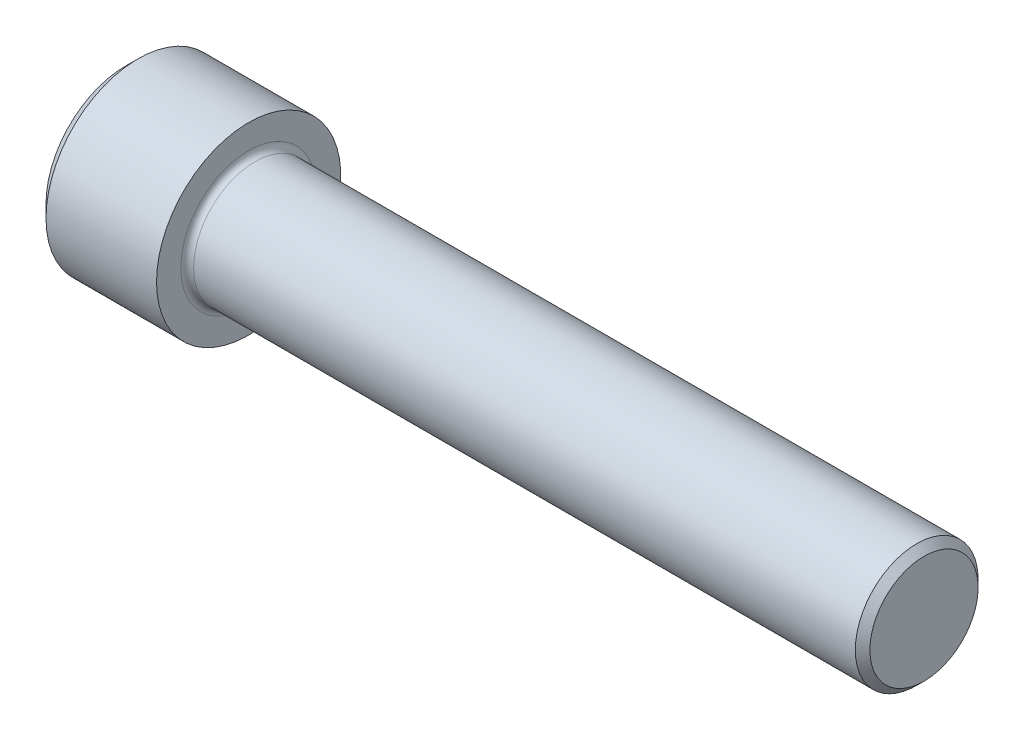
ISO-10303-21;
HEADER;
FILE_DESCRIPTION(('STEP AP214'),'2;1');
FILE_NAME('part.step','',(''),(''),'','','');
FILE_SCHEMA(('AUTOMOTIVE_DESIGN { 1 0 10303 214 1 1 1 1 }'));
ENDSEC;
DATA;
#1=APPLICATION_CONTEXT('core data for automotive mechanical design processes');
#2=APPLICATION_PROTOCOL_DEFINITION('international standard','automotive_design',2000,#1);
#3=PRODUCT_CONTEXT('',#1,'mechanical');
#4=PRODUCT('Part','Part','',(#3));
#5=PRODUCT_RELATED_PRODUCT_CATEGORY('part','',(#4));
#6=PRODUCT_DEFINITION_FORMATION('','',#4);
#7=PRODUCT_DEFINITION_CONTEXT('part definition',#1,'design');
#8=PRODUCT_DEFINITION('design','',#6,#7);
#9=PRODUCT_DEFINITION_SHAPE('','',#8);
#10=(LENGTH_UNIT() NAMED_UNIT(*) SI_UNIT(.MILLI.,.METRE.));
#11=(NAMED_UNIT(*) PLANE_ANGLE_UNIT() SI_UNIT($,.RADIAN.));
#12=(NAMED_UNIT(*) SI_UNIT($,.STERADIAN.) SOLID_ANGLE_UNIT());
#13=UNCERTAINTY_MEASURE_WITH_UNIT(LENGTH_MEASURE(1.E-05),#10,'distance_accuracy_value','');
#14=(GEOMETRIC_REPRESENTATION_CONTEXT(3) GLOBAL_UNCERTAINTY_ASSIGNED_CONTEXT((#13)) GLOBAL_UNIT_ASSIGNED_CONTEXT((#10,
#11,#12)) REPRESENTATION_CONTEXT('',''));
#15=CARTESIAN_POINT('',(0.,0.,0.));
#16=DIRECTION('',(0.,0.,1.));
#17=DIRECTION('',(1.,0.,0.));
#18=AXIS2_PLACEMENT_3D('',#15,#16,#17);
#19=CARTESIAN_POINT('',(0.,0.,0.));
#20=DIRECTION('',(-1.,0.,0.));
#21=DIRECTION('',(0.,0.,1.));
#22=AXIS2_PLACEMENT_3D('',#19,#20,#21);
#23=PLANE('',#22);
#24=DIRECTION('',(0.,-0.499999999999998,0.86602540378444));
#25=VECTOR('',#24,1.);
#26=CARTESIAN_POINT('',(0.,5.49926131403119,0.));
#27=LINE('',#26,#25);
#28=CARTESIAN_POINT('',(0.,5.49926131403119,0.));
#29=VERTEX_POINT('',#28);
#30=CARTESIAN_POINT('',(0.,2.74963065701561,4.76249999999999));
#31=VERTEX_POINT('',#30);
#32=EDGE_CURVE('E113',#29,#31,#27,.T.);
#33=ORIENTED_EDGE('',*,*,#32,.T.);
#34=DIRECTION('',(0.,1.,0.));
#35=VECTOR('',#34,1.);
#36=CARTESIAN_POINT('',(0.,-2.74963065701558,4.7625));
#37=LINE('',#36,#35);
#38=CARTESIAN_POINT('',(0.,-2.74963065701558,4.7625));
#39=VERTEX_POINT('',#38);
#40=EDGE_CURVE('E102',#39,#31,#37,.T.);
#41=ORIENTED_EDGE('',*,*,#40,.F.);
#42=DIRECTION('',(0.,-0.500000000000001,-0.866025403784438));
#43=VECTOR('',#42,1.);
#44=CARTESIAN_POINT('',(0.,-2.74963065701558,4.7625));
#45=LINE('',#44,#43);
#46=CARTESIAN_POINT('',(0.,-5.49926131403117,0.));
#47=VERTEX_POINT('',#46);
#48=EDGE_CURVE('E112',#39,#47,#45,.T.);
#49=ORIENTED_EDGE('',*,*,#48,.T.);
#50=DIRECTION('',(0.,0.499999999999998,-0.86602540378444));
#51=VECTOR('',#50,1.);
#52=CARTESIAN_POINT('',(0.,-5.49926131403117,0.));
#53=LINE('',#52,#51);
#54=CARTESIAN_POINT('',(0.,-2.74963065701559,-4.7625));
#55=VERTEX_POINT('',#54);
#56=EDGE_CURVE('E131',#47,#55,#53,.T.);
#57=ORIENTED_EDGE('',*,*,#56,.T.);
#58=DIRECTION('',(0.,-1.,0.));
#59=VECTOR('',#58,1.);
#60=CARTESIAN_POINT('',(0.,2.74963065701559,-4.76250000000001));
#61=LINE('',#60,#59);
#62=CARTESIAN_POINT('',(0.,2.74963065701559,-4.76250000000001));
#63=VERTEX_POINT('',#62);
#64=EDGE_CURVE('E134',#63,#55,#61,.T.);
#65=ORIENTED_EDGE('',*,*,#64,.F.);
#66=DIRECTION('',(0.,-0.500000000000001,-0.866025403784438));
#67=VECTOR('',#66,1.);
#68=CARTESIAN_POINT('',(0.,5.49926131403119,0.));
#69=LINE('',#68,#67);
#70=EDGE_CURVE('E127',#29,#63,#69,.T.);
#71=ORIENTED_EDGE('',*,*,#70,.F.);
#72=EDGE_LOOP('',(#33,#41,#49,#57,#65,#71));
#73=FACE_BOUND('',#72,.T.);
#74=CARTESIAN_POINT('',(0.,0.,0.));
#75=DIRECTION('',(-1.,0.,0.));
#76=DIRECTION('',(0.,0.,1.));
#77=AXIS2_PLACEMENT_3D('',#74,#75,#76);
#78=CIRCLE('',#77,8.255);
#79=CARTESIAN_POINT('',(0.,0.,8.255));
#80=VERTEX_POINT('',#79);
#81=EDGE_CURVE('E172',#80,#80,#78,.T.);
#82=ORIENTED_EDGE('',*,*,#81,.T.);
#83=EDGE_LOOP('',(#82));
#84=FACE_BOUND('',#83,.T.);
#85=ADVANCED_FACE('F30',(#73,#84),#23,.T.);
#86=CARTESIAN_POINT('',(82.55,5.59435,0.));
#87=DIRECTION('',(1.,0.,0.));
#88=DIRECTION('',(0.,0.,-1.));
#89=AXIS2_PLACEMENT_3D('',#86,#87,#88);
#90=PLANE('',#89);
#91=CARTESIAN_POINT('',(82.55,0.,0.));
#92=DIRECTION('',(-1.,0.,0.));
#93=DIRECTION('',(0.,0.,1.));
#94=AXIS2_PLACEMENT_3D('',#91,#92,#93);
#95=CIRCLE('',#94,5.59435);
#96=CARTESIAN_POINT('',(82.55,0.,5.59435));
#97=VERTEX_POINT('',#96);
#98=EDGE_CURVE('E185',#97,#97,#95,.T.);
#99=ORIENTED_EDGE('',*,*,#98,.F.);
#100=EDGE_LOOP('',(#99));
#101=FACE_BOUND('',#100,.T.);
#102=ADVANCED_FACE('F32',(#101),#90,.T.);
#103=CARTESIAN_POINT('',(82.55,0.,0.));
#104=DIRECTION('',(-1.,0.,0.));
#105=DIRECTION('',(0.,0.,1.));
#106=AXIS2_PLACEMENT_3D('',#103,#104,#105);
#107=CONICAL_SURFACE('',#106,5.59435,0.785398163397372);
#108=CARTESIAN_POINT('',(81.79435,0.,0.));
#109=DIRECTION('',(-1.,0.,0.));
#110=DIRECTION('',(0.,0.,1.));
#111=AXIS2_PLACEMENT_3D('',#108,#109,#110);
#112=CIRCLE('',#111,6.34999999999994);
#113=CARTESIAN_POINT('',(81.79435,0.,6.34999999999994));
#114=VERTEX_POINT('',#113);
#115=EDGE_CURVE('E182',#114,#114,#112,.T.);
#116=ORIENTED_EDGE('',*,*,#115,.F.);
#117=EDGE_LOOP('',(#116));
#118=FACE_BOUND('',#117,.T.);
#119=ORIENTED_EDGE('',*,*,#98,.T.);
#120=EDGE_LOOP('',(#119));
#121=FACE_BOUND('',#120,.T.);
#122=ADVANCED_FACE('F213',(#118,#121),#107,.T.);
#123=CARTESIAN_POINT('',(-31.75,0.,0.));
#124=DIRECTION('',(-1.,0.,0.));
#125=DIRECTION('',(0.,0.,1.));
#126=AXIS2_PLACEMENT_3D('',#123,#124,#125);
#127=CYLINDRICAL_SURFACE('',#126,6.34999999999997);
#128=CARTESIAN_POINT('',(13.3604,0.,0.));
#129=DIRECTION('',(1.,0.,0.));
#130=DIRECTION('',(0.,0.,-1.));
#131=AXIS2_PLACEMENT_3D('',#128,#129,#130);
#132=CIRCLE('',#131,6.34999999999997);
#133=CARTESIAN_POINT('',(13.3604,0.,-6.34999999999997));
#134=VERTEX_POINT('',#133);
#135=EDGE_CURVE('E11',#134,#134,#132,.T.);
#136=ORIENTED_EDGE('',*,*,#135,.T.);
#137=EDGE_LOOP('',(#136));
#138=FACE_BOUND('',#137,.T.);
#139=ORIENTED_EDGE('',*,*,#115,.T.);
#140=EDGE_LOOP('',(#139));
#141=FACE_BOUND('',#140,.T.);
#142=ADVANCED_FACE('F221',(#138,#141),#127,.T.);
#143=CARTESIAN_POINT('',(12.7,9.525,0.));
#144=DIRECTION('',(1.,0.,0.));
#145=DIRECTION('',(0.,0.,-1.));
#146=AXIS2_PLACEMENT_3D('',#143,#144,#145);
#147=PLANE('',#146);
#148=CARTESIAN_POINT('',(12.7,0.,0.));
#149=DIRECTION('',(1.,0.,0.));
#150=DIRECTION('',(0.,0.,-1.));
#151=AXIS2_PLACEMENT_3D('',#148,#149,#150);
#152=CIRCLE('',#151,7.01039999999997);
#153=CARTESIAN_POINT('',(12.7,0.,-7.01039999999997));
#154=VERTEX_POINT('',#153);
#155=EDGE_CURVE('E38',#154,#154,#152,.F.);
#156=ORIENTED_EDGE('',*,*,#155,.T.);
#157=EDGE_LOOP('',(#156));
#158=FACE_BOUND('',#157,.T.);
#159=CARTESIAN_POINT('',(12.7,0.,0.));
#160=DIRECTION('',(-1.,0.,0.));
#161=DIRECTION('',(0.,0.,1.));
#162=AXIS2_PLACEMENT_3D('',#159,#160,#161);
#163=CIRCLE('',#162,9.525);
#164=CARTESIAN_POINT('',(12.7,0.,9.525));
#165=VERTEX_POINT('',#164);
#166=EDGE_CURVE('E179',#165,#165,#163,.T.);
#167=ORIENTED_EDGE('',*,*,#166,.F.);
#168=EDGE_LOOP('',(#167));
#169=FACE_BOUND('',#168,.T.);
#170=ADVANCED_FACE('F190',(#158,#169),#147,.T.);
#171=CARTESIAN_POINT('',(-31.75,0.,0.));
#172=DIRECTION('',(-1.,0.,0.));
#173=DIRECTION('',(0.,0.,1.));
#174=AXIS2_PLACEMENT_3D('',#171,#172,#173);
#175=CYLINDRICAL_SURFACE('',#174,9.525);
#176=ORIENTED_EDGE('',*,*,#166,.T.);
#177=EDGE_LOOP('',(#176));
#178=FACE_BOUND('',#177,.T.);
#179=CARTESIAN_POINT('',(1.27,0.,0.));
#180=DIRECTION('',(-1.,0.,0.));
#181=DIRECTION('',(0.,0.,1.));
#182=AXIS2_PLACEMENT_3D('',#179,#180,#181);
#183=CIRCLE('',#182,9.525);
#184=CARTESIAN_POINT('',(1.27,0.,9.525));
#185=VERTEX_POINT('',#184);
#186=EDGE_CURVE('E176',#185,#185,#183,.T.);
#187=ORIENTED_EDGE('',*,*,#186,.F.);
#188=EDGE_LOOP('',(#187));
#189=FACE_BOUND('',#188,.T.);
#190=ADVANCED_FACE('F203',(#178,#189),#175,.T.);
#191=CARTESIAN_POINT('',(0.,0.,0.));
#192=DIRECTION('',(1.,0.,0.));
#193=DIRECTION('',(0.,0.,-1.));
#194=AXIS2_PLACEMENT_3D('',#191,#192,#193);
#195=CONICAL_SURFACE('',#194,8.255,0.78539816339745);
#196=ORIENTED_EDGE('',*,*,#186,.T.);
#197=EDGE_LOOP('',(#196));
#198=FACE_BOUND('',#197,.T.);
#199=ORIENTED_EDGE('',*,*,#81,.F.);
#200=EDGE_LOOP('',(#199));
#201=FACE_BOUND('',#200,.T.);
#202=ADVANCED_FACE('F195',(#198,#201),#195,.T.);
#203=CARTESIAN_POINT('',(13.3604,0.,0.));
#204=DIRECTION('',(1.,0.,0.));
#205=DIRECTION('',(0.,0.,-1.));
#206=AXIS2_PLACEMENT_3D('',#203,#204,#205);
#207=TOROIDAL_SURFACE('',#206,7.01039999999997,0.6604);
#208=ORIENTED_EDGE('',*,*,#135,.F.);
#209=EDGE_LOOP('',(#208));
#210=FACE_BOUND('',#209,.T.);
#211=ORIENTED_EDGE('',*,*,#155,.F.);
#212=EDGE_LOOP('',(#211));
#213=FACE_BOUND('',#212,.T.);
#214=ADVANCED_FACE('F193',(#210,#213),#207,.F.);
#215=CARTESIAN_POINT('',(6.223,5.49926131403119,0.));
#216=DIRECTION('',(0.,-0.86602540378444,-0.499999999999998));
#217=DIRECTION('',(0.,0.499999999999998,-0.86602540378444));
#218=AXIS2_PLACEMENT_3D('',#215,#216,#217);
#219=PLANE('',#218);
#220=ORIENTED_EDGE('',*,*,#32,.F.);
#221=DIRECTION('',(-1.,0.,0.));
#222=VECTOR('',#221,1.);
#223=CARTESIAN_POINT('',(6.223,5.49926131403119,0.));
#224=LINE('',#223,#222);
#225=CARTESIAN_POINT('',(6.223,5.49926131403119,0.));
#226=VERTEX_POINT('',#225);
#227=EDGE_CURVE('E157',#226,#29,#224,.T.);
#228=ORIENTED_EDGE('',*,*,#227,.F.);
#229=DIRECTION('',(0.,-0.499999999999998,0.86602540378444));
#230=VECTOR('',#229,1.);
#231=CARTESIAN_POINT('',(6.223,5.49926131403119,0.));
#232=LINE('',#231,#230);
#233=CARTESIAN_POINT('',(6.223,4.1244459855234,2.38124999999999));
#234=VERTEX_POINT('',#233);
#235=EDGE_CURVE('E137',#226,#234,#232,.T.);
#236=ORIENTED_EDGE('',*,*,#235,.T.);
#237=CARTESIAN_POINT('',(6.223,2.74963065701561,4.76249999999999));
#238=VERTEX_POINT('',#237);
#239=EDGE_CURVE('E121',#234,#238,#232,.T.);
#240=ORIENTED_EDGE('',*,*,#239,.T.);
#241=DIRECTION('',(-1.,0.,0.));
#242=VECTOR('',#241,1.);
#243=CARTESIAN_POINT('',(6.223,2.74963065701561,4.76249999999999));
#244=LINE('',#243,#242);
#245=EDGE_CURVE('E106',#238,#31,#244,.T.);
#246=ORIENTED_EDGE('',*,*,#245,.T.);
#247=EDGE_LOOP('',(#220,#228,#236,#240,#246));
#248=FACE_BOUND('',#247,.T.);
#249=ADVANCED_FACE('F117',(#248),#219,.T.);
#250=CARTESIAN_POINT('',(6.223,-2.74963065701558,4.7625));
#251=DIRECTION('',(0.,0.,1.));
#252=DIRECTION('',(0.,-1.,0.));
#253=AXIS2_PLACEMENT_3D('',#250,#251,#252);
#254=PLANE('',#253);
#255=ORIENTED_EDGE('',*,*,#40,.T.);
#256=ORIENTED_EDGE('',*,*,#245,.F.);
#257=DIRECTION('',(0.,1.,0.));
#258=VECTOR('',#257,1.);
#259=CARTESIAN_POINT('',(6.223,-2.74963065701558,4.7625));
#260=LINE('',#259,#258);
#261=CARTESIAN_POINT('',(6.223,0.,4.76249999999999));
#262=VERTEX_POINT('',#261);
#263=EDGE_CURVE('E139',#262,#238,#260,.T.);
#264=ORIENTED_EDGE('',*,*,#263,.F.);
#265=CARTESIAN_POINT('',(6.223,-2.74963065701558,4.7625));
#266=VERTEX_POINT('',#265);
#267=EDGE_CURVE('E140',#266,#262,#260,.T.);
#268=ORIENTED_EDGE('',*,*,#267,.F.);
#269=DIRECTION('',(-1.,0.,0.));
#270=VECTOR('',#269,1.);
#271=CARTESIAN_POINT('',(6.223,-2.74963065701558,4.7625));
#272=LINE('',#271,#270);
#273=EDGE_CURVE('E108',#266,#39,#272,.T.);
#274=ORIENTED_EDGE('',*,*,#273,.T.);
#275=EDGE_LOOP('',(#255,#256,#264,#268,#274));
#276=FACE_BOUND('',#275,.T.);
#277=ADVANCED_FACE('F104',(#276),#254,.F.);
#278=CARTESIAN_POINT('',(6.223,-2.74963065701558,4.7625));
#279=DIRECTION('',(0.,0.866025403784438,-0.500000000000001));
#280=DIRECTION('',(0.,0.500000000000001,0.866025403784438));
#281=AXIS2_PLACEMENT_3D('',#278,#279,#280);
#282=PLANE('',#281);
#283=ORIENTED_EDGE('',*,*,#48,.F.);
#284=ORIENTED_EDGE('',*,*,#273,.F.);
#285=DIRECTION('',(0.,-0.500000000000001,-0.866025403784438));
#286=VECTOR('',#285,1.);
#287=CARTESIAN_POINT('',(6.223,-2.74963065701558,4.7625));
#288=LINE('',#287,#286);
#289=CARTESIAN_POINT('',(6.223,-4.12444598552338,2.38125));
#290=VERTEX_POINT('',#289);
#291=EDGE_CURVE('E144',#266,#290,#288,.T.);
#292=ORIENTED_EDGE('',*,*,#291,.T.);
#293=CARTESIAN_POINT('',(6.223,-5.49926131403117,0.));
#294=VERTEX_POINT('',#293);
#295=EDGE_CURVE('E143',#290,#294,#288,.T.);
#296=ORIENTED_EDGE('',*,*,#295,.T.);
#297=DIRECTION('',(-1.,0.,0.));
#298=VECTOR('',#297,1.);
#299=CARTESIAN_POINT('',(6.223,-5.49926131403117,0.));
#300=LINE('',#299,#298);
#301=EDGE_CURVE('E165',#294,#47,#300,.T.);
#302=ORIENTED_EDGE('',*,*,#301,.T.);
#303=EDGE_LOOP('',(#283,#284,#292,#296,#302));
#304=FACE_BOUND('',#303,.T.);
#305=ADVANCED_FACE('F284',(#304),#282,.T.);
#306=CARTESIAN_POINT('',(6.223,-5.49926131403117,0.));
#307=DIRECTION('',(0.,0.86602540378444,0.499999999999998));
#308=DIRECTION('',(0.,-0.499999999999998,0.86602540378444));
#309=AXIS2_PLACEMENT_3D('',#306,#307,#308);
#310=PLANE('',#309);
#311=ORIENTED_EDGE('',*,*,#56,.F.);
#312=ORIENTED_EDGE('',*,*,#301,.F.);
#313=DIRECTION('',(0.,0.499999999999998,-0.86602540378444));
#314=VECTOR('',#313,1.);
#315=CARTESIAN_POINT('',(6.223,-5.49926131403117,0.));
#316=LINE('',#315,#314);
#317=CARTESIAN_POINT('',(6.223,-4.12444598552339,-2.38124999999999));
#318=VERTEX_POINT('',#317);
#319=EDGE_CURVE('E148',#294,#318,#316,.T.);
#320=ORIENTED_EDGE('',*,*,#319,.T.);
#321=CARTESIAN_POINT('',(6.223,-2.74963065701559,-4.7625));
#322=VERTEX_POINT('',#321);
#323=EDGE_CURVE('E147',#318,#322,#316,.T.);
#324=ORIENTED_EDGE('',*,*,#323,.T.);
#325=DIRECTION('',(-1.,0.,0.));
#326=VECTOR('',#325,1.);
#327=CARTESIAN_POINT('',(6.223,-2.74963065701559,-4.7625));
#328=LINE('',#327,#326);
#329=EDGE_CURVE('E162',#322,#55,#328,.T.);
#330=ORIENTED_EDGE('',*,*,#329,.T.);
#331=EDGE_LOOP('',(#311,#312,#320,#324,#330));
#332=FACE_BOUND('',#331,.T.);
#333=ADVANCED_FACE('F292',(#332),#310,.T.);
#334=CARTESIAN_POINT('',(6.223,2.74963065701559,-4.76250000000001));
#335=DIRECTION('',(0.,0.,-1.));
#336=DIRECTION('',(0.,1.,0.));
#337=AXIS2_PLACEMENT_3D('',#334,#335,#336);
#338=PLANE('',#337);
#339=ORIENTED_EDGE('',*,*,#64,.T.);
#340=ORIENTED_EDGE('',*,*,#329,.F.);
#341=DIRECTION('',(0.,-1.,0.));
#342=VECTOR('',#341,1.);
#343=CARTESIAN_POINT('',(6.223,2.74963065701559,-4.76250000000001));
#344=LINE('',#343,#342);
#345=CARTESIAN_POINT('',(6.223,0.,-4.7625));
#346=VERTEX_POINT('',#345);
#347=EDGE_CURVE('E151',#346,#322,#344,.T.);
#348=ORIENTED_EDGE('',*,*,#347,.F.);
#349=CARTESIAN_POINT('',(6.223,2.74963065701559,-4.76250000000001));
#350=VERTEX_POINT('',#349);
#351=EDGE_CURVE('E45',#350,#346,#344,.T.);
#352=ORIENTED_EDGE('',*,*,#351,.F.);
#353=DIRECTION('',(-1.,0.,0.));
#354=VECTOR('',#353,1.);
#355=CARTESIAN_POINT('',(6.223,2.74963065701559,-4.76250000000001));
#356=LINE('',#355,#354);
#357=EDGE_CURVE('E159',#350,#63,#356,.T.);
#358=ORIENTED_EDGE('',*,*,#357,.T.);
#359=EDGE_LOOP('',(#339,#340,#348,#352,#358));
#360=FACE_BOUND('',#359,.T.);
#361=ADVANCED_FACE('F301',(#360),#338,.F.);
#362=CARTESIAN_POINT('',(6.223,5.49926131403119,0.));
#363=DIRECTION('',(0.,0.866025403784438,-0.500000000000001));
#364=DIRECTION('',(0.,0.500000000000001,0.866025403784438));
#365=AXIS2_PLACEMENT_3D('',#362,#363,#364);
#366=PLANE('',#365);
#367=ORIENTED_EDGE('',*,*,#70,.T.);
#368=ORIENTED_EDGE('',*,*,#357,.F.);
#369=DIRECTION('',(0.,-0.500000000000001,-0.866025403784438));
#370=VECTOR('',#369,1.);
#371=CARTESIAN_POINT('',(6.223,5.49926131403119,0.));
#372=LINE('',#371,#370);
#373=CARTESIAN_POINT('',(6.223,4.12444598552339,-2.38125000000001));
#374=VERTEX_POINT('',#373);
#375=EDGE_CURVE('E153',#374,#350,#372,.T.);
#376=ORIENTED_EDGE('',*,*,#375,.F.);
#377=EDGE_CURVE('E154',#226,#374,#372,.T.);
#378=ORIENTED_EDGE('',*,*,#377,.F.);
#379=ORIENTED_EDGE('',*,*,#227,.T.);
#380=EDGE_LOOP('',(#367,#368,#376,#378,#379));
#381=FACE_BOUND('',#380,.T.);
#382=ADVANCED_FACE('F310',(#381),#366,.F.);
#383=CARTESIAN_POINT('',(6.223,8.24889197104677,-4.76250000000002));
#384=DIRECTION('',(1.,0.,0.));
#385=DIRECTION('',(0.,0.,-1.));
#386=AXIS2_PLACEMENT_3D('',#383,#384,#385);
#387=PLANE('',#386);
#388=ORIENTED_EDGE('',*,*,#347,.T.);
#389=ORIENTED_EDGE('',*,*,#323,.F.);
#390=CARTESIAN_POINT('',(6.223,0.,0.));
#391=DIRECTION('',(-1.,0.,0.));
#392=DIRECTION('',(0.,0.,1.));
#393=AXIS2_PLACEMENT_3D('',#390,#391,#392);
#394=CIRCLE('',#393,4.7625);
#395=EDGE_CURVE('E390',#346,#318,#394,.T.);
#396=ORIENTED_EDGE('',*,*,#395,.F.);
#397=EDGE_LOOP('',(#388,#389,#396));
#398=FACE_BOUND('',#397,.T.);
#399=ADVANCED_FACE('F319',(#398),#387,.F.);
#400=ORIENTED_EDGE('',*,*,#319,.F.);
#401=ORIENTED_EDGE('',*,*,#295,.F.);
#402=EDGE_CURVE('E393',#318,#290,#394,.T.);
#403=ORIENTED_EDGE('',*,*,#402,.F.);
#404=EDGE_LOOP('',(#400,#401,#403));
#405=FACE_BOUND('',#404,.T.);
#406=ADVANCED_FACE('F328',(#405),#387,.F.);
#407=ORIENTED_EDGE('',*,*,#291,.F.);
#408=ORIENTED_EDGE('',*,*,#267,.T.);
#409=EDGE_CURVE('E122',#290,#262,#394,.T.);
#410=ORIENTED_EDGE('',*,*,#409,.F.);
#411=EDGE_LOOP('',(#407,#408,#410));
#412=FACE_BOUND('',#411,.T.);
#413=ADVANCED_FACE('F337',(#412),#387,.F.);
#414=ORIENTED_EDGE('',*,*,#263,.T.);
#415=ORIENTED_EDGE('',*,*,#239,.F.);
#416=EDGE_CURVE('E169',#262,#234,#394,.T.);
#417=ORIENTED_EDGE('',*,*,#416,.F.);
#418=EDGE_LOOP('',(#414,#415,#417));
#419=FACE_BOUND('',#418,.T.);
#420=ADVANCED_FACE('F345',(#419),#387,.F.);
#421=ORIENTED_EDGE('',*,*,#235,.F.);
#422=ORIENTED_EDGE('',*,*,#377,.T.);
#423=EDGE_CURVE('E173',#234,#374,#394,.T.);
#424=ORIENTED_EDGE('',*,*,#423,.F.);
#425=EDGE_LOOP('',(#421,#422,#424));
#426=FACE_BOUND('',#425,.T.);
#427=ADVANCED_FACE('F353',(#426),#387,.F.);
#428=ORIENTED_EDGE('',*,*,#375,.T.);
#429=ORIENTED_EDGE('',*,*,#351,.T.);
#430=EDGE_CURVE('E383',#374,#346,#394,.T.);
#431=ORIENTED_EDGE('',*,*,#430,.F.);
#432=EDGE_LOOP('',(#428,#429,#431));
#433=FACE_BOUND('',#432,.T.);
#434=ADVANCED_FACE('F267',(#433),#387,.F.);
#435=CARTESIAN_POINT('',(6.223,0.,0.));
#436=DIRECTION('',(-1.,0.,0.));
#437=DIRECTION('',(0.,0.,1.));
#438=AXIS2_PLACEMENT_3D('',#435,#436,#437);
#439=CONICAL_SURFACE('',#438,4.7625,1.04719755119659);
#440=CARTESIAN_POINT('',(8.97263065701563,0.,0.));
#441=VERTEX_POINT('',#440);
#442=VERTEX_LOOP('',#441);
#443=FACE_BOUND('',#442,.T.);
#444=ORIENTED_EDGE('',*,*,#416,.T.);
#445=ORIENTED_EDGE('',*,*,#423,.T.);
#446=ORIENTED_EDGE('',*,*,#430,.T.);
#447=ORIENTED_EDGE('',*,*,#395,.T.);
#448=ORIENTED_EDGE('',*,*,#402,.T.);
#449=ORIENTED_EDGE('',*,*,#409,.T.);
#450=EDGE_LOOP('',(#444,#445,#446,#447,#448,#449));
#451=FACE_BOUND('',#450,.T.);
#452=ADVANCED_FACE('F261',(#443,#451),#439,.F.);
#453=CLOSED_SHELL('',(#85,#102,#122,#142,#170,#190,#202,#214,#249,#277,#305,#333,#361,#382,#399,
#406,#413,#420,#427,#434,#452));
#454=MANIFOLD_SOLID_BREP('B2',#453);
#455=ADVANCED_BREP_SHAPE_REPRESENTATION('',(#18,#454),#14);
#456=SHAPE_DEFINITION_REPRESENTATION(#9,#455);
ENDSEC;
END-ISO-10303-21;
